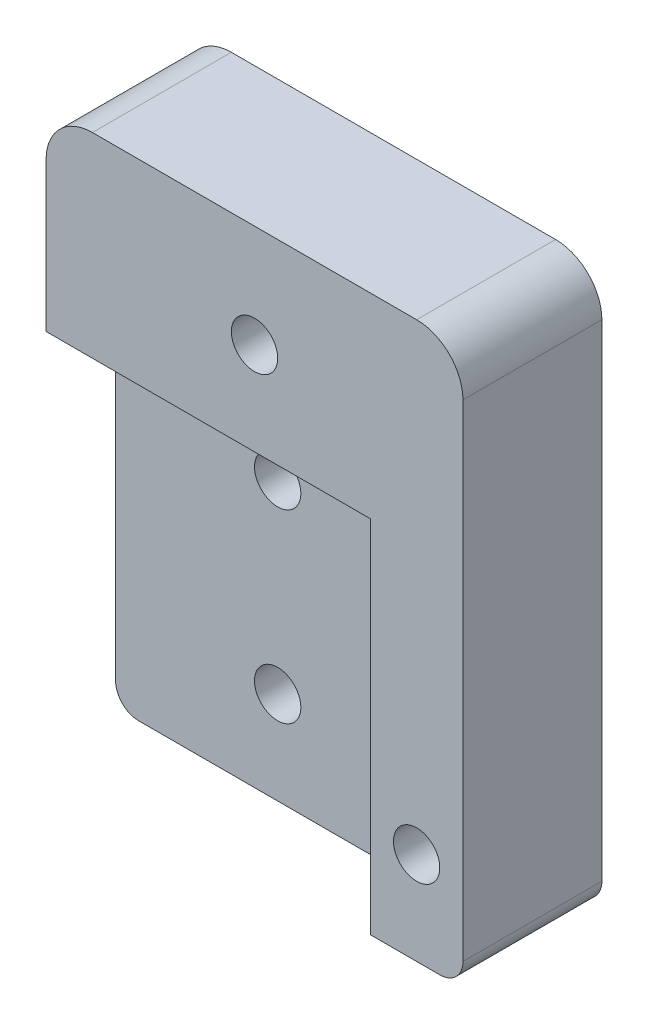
from build123d import *

# Parameters (mm, degrees)
SKETCH1_R           = 3.175
BOSS_EXTRUDE1_DEPTH = 19.05
CUT_EXTRUDE1_DEPTH  = 9.525


with BuildPart() as part:
    # Sketch1 → Boss-Extrude1 (new body)
    with BuildSketch(Plane.XY):
        with BuildLine():
            Line((3.175, 0), (53.975, 0))
            ThreePointArc((53.975, 0), (56.22006403, 0.92993597), (57.15, 3.175))
            Line((57.15, 3.175), (57.15, 69.85))
            ThreePointArc((57.15, 69.85), (55.290128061, 74.340128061), (50.8, 76.2))
            Line((50.8, 76.2), (6.35, 76.2))
            ThreePointArc((6.35, 76.2), (1.859871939, 74.340128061), (0, 69.85))
            Line((0, 69.85), (0, 3.175))
            ThreePointArc((0, 3.175), (0.92993597, 0.92993597), (3.175, 0))
        make_face()
        with Locations(Location((22.225, 12.7, 0), (0, 0, 180))):
            Circle(SKETCH1_R, mode=Mode.SUBTRACT)
        with Locations(Location((22.225, 38.1, 0), (0, 0, 180))):
            Circle(SKETCH1_R, mode=Mode.SUBTRACT)
        with Locations(Location((50.8, 12.7, 0), (0, 0, 180))):
            Circle(SKETCH1_R, mode=Mode.SUBTRACT)
        with Locations(Location((28.575, 62.096854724, 0), (0, 0, 180))):
            Circle(SKETCH1_R, mode=Mode.SUBTRACT)
    extrude(amount=BOSS_EXTRUDE1_DEPTH)

    # Sketch2 → Cut-Extrude1 (cut)
    with BuildSketch(Plane.XY.offset(19.05)):
        Polygon((22.225, 49.396854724), (44.45, 49.396854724), (44.45, 0), (0, 0), (0, 49.396854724), align=None)
    extrude(amount=-CUT_EXTRUDE1_DEPTH, mode=Mode.SUBTRACT)


solid = part.part
